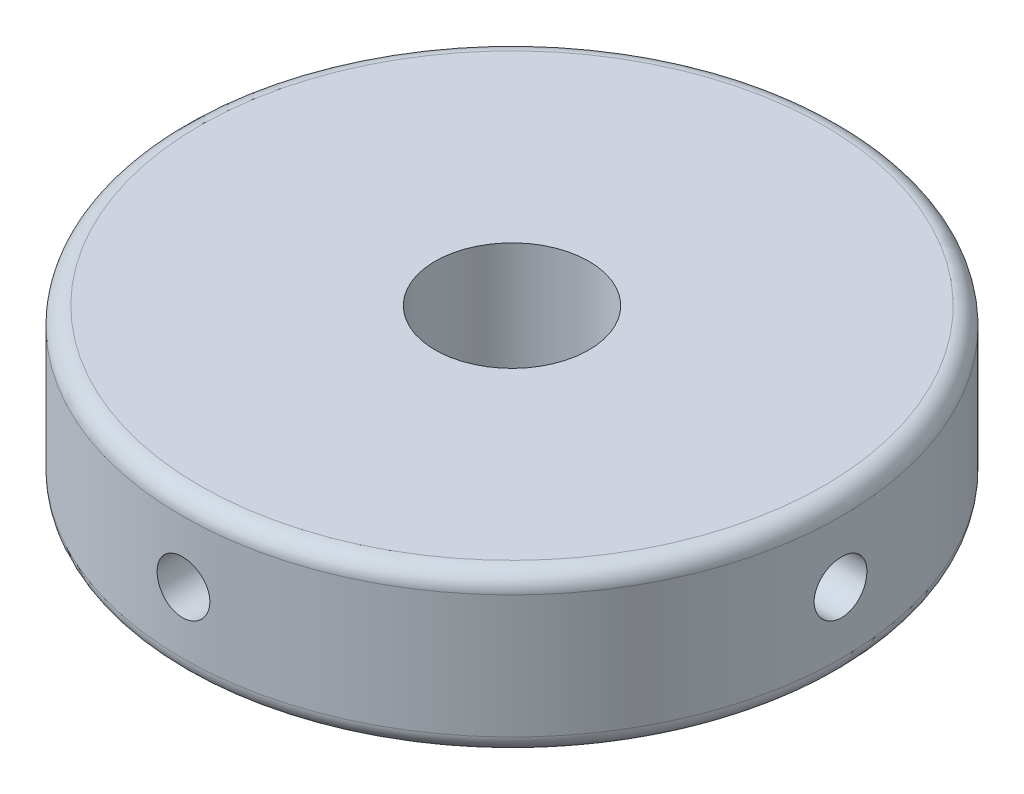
ISO-10303-21;
HEADER;
FILE_DESCRIPTION(('STEP AP214'),'2;1');
FILE_NAME('part.step','',(''),(''),'','','');
FILE_SCHEMA(('AUTOMOTIVE_DESIGN { 1 0 10303 214 1 1 1 1 }'));
ENDSEC;
DATA;
#1=APPLICATION_CONTEXT('core data for automotive mechanical design processes');
#2=APPLICATION_PROTOCOL_DEFINITION('international standard','automotive_design',2000,#1);
#3=PRODUCT_CONTEXT('',#1,'mechanical');
#4=PRODUCT('Part','Part','',(#3));
#5=PRODUCT_RELATED_PRODUCT_CATEGORY('part','',(#4));
#6=PRODUCT_DEFINITION_FORMATION('','',#4);
#7=PRODUCT_DEFINITION_CONTEXT('part definition',#1,'design');
#8=PRODUCT_DEFINITION('design','',#6,#7);
#9=PRODUCT_DEFINITION_SHAPE('','',#8);
#10=(LENGTH_UNIT() NAMED_UNIT(*) SI_UNIT(.MILLI.,.METRE.));
#11=(NAMED_UNIT(*) PLANE_ANGLE_UNIT() SI_UNIT($,.RADIAN.));
#12=(NAMED_UNIT(*) SI_UNIT($,.STERADIAN.) SOLID_ANGLE_UNIT());
#13=UNCERTAINTY_MEASURE_WITH_UNIT(LENGTH_MEASURE(1.E-05),#10,'distance_accuracy_value','');
#14=(GEOMETRIC_REPRESENTATION_CONTEXT(3) GLOBAL_UNCERTAINTY_ASSIGNED_CONTEXT((#13)) GLOBAL_UNIT_ASSIGNED_CONTEXT((#10,
#11,#12)) REPRESENTATION_CONTEXT('',''));
#15=CARTESIAN_POINT('',(0.,0.,0.));
#16=DIRECTION('',(0.,0.,1.));
#17=DIRECTION('',(1.,0.,0.));
#18=AXIS2_PLACEMENT_3D('',#15,#16,#17);
#19=CARTESIAN_POINT('',(0.,18.,0.));
#20=DIRECTION('',(0.,-1.,0.));
#21=DIRECTION('',(0.,0.,-1.));
#22=AXIS2_PLACEMENT_3D('',#19,#20,#21);
#23=CYLINDRICAL_SURFACE('',#22,37.5);
#24=CARTESIAN_POINT('',(0.,2.,0.));
#25=DIRECTION('',(0.,1.,0.));
#26=DIRECTION('',(0.,0.,1.));
#27=AXIS2_PLACEMENT_3D('',#24,#25,#26);
#28=CIRCLE('',#27,37.5);
#29=CARTESIAN_POINT('',(0.,2.,37.5));
#30=VERTEX_POINT('',#29);
#31=EDGE_CURVE('E150',#30,#30,#28,.T.);
#32=ORIENTED_EDGE('',*,*,#31,.T.);
#33=EDGE_LOOP('',(#32));
#34=FACE_BOUND('',#33,.T.);
#35=CARTESIAN_POINT('',(0.,16.,0.));
#36=DIRECTION('',(0.,1.,0.));
#37=DIRECTION('',(0.,0.,1.));
#38=AXIS2_PLACEMENT_3D('',#35,#36,#37);
#39=CIRCLE('',#38,37.5);
#40=CARTESIAN_POINT('',(0.,16.,37.5));
#41=VERTEX_POINT('',#40);
#42=EDGE_CURVE('E144',#41,#41,#39,.F.);
#43=ORIENTED_EDGE('',*,*,#42,.T.);
#44=EDGE_LOOP('',(#43));
#45=FACE_BOUND('',#44,.T.);
#46=CARTESIAN_POINT('',(2.99999999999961,9.00000000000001,37.3798073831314));
#47=CARTESIAN_POINT('',(2.99999264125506,8.83177821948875,37.3798089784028));
#48=CARTESIAN_POINT('',(2.98580312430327,8.6634413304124,37.3809551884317));
#49=CARTESIAN_POINT('',(2.92940637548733,8.33142351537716,37.3854162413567));
#50=CARTESIAN_POINT('',(2.88716724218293,8.16774811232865,37.3887335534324));
#51=CARTESIAN_POINT('',(2.77589918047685,7.84991016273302,37.3971586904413));
#52=CARTESIAN_POINT('',(2.70688525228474,7.69574234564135,37.4022655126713));
#53=CARTESIAN_POINT('',(2.54405292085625,7.40121643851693,37.4136930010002));
#54=CARTESIAN_POINT('',(2.45023988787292,7.26085536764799,37.4200134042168));
#55=CARTESIAN_POINT('',(2.24023103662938,6.99755638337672,37.4331727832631));
#56=CARTESIAN_POINT('',(2.12398849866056,6.87465578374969,37.4400128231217));
#57=CARTESIAN_POINT('',(1.87251889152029,6.65008682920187,37.4534310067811));
#58=CARTESIAN_POINT('',(1.7372910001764,6.54841939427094,37.4600091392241));
#59=CARTESIAN_POINT('',(1.4514683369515,6.36907984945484,37.4721722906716));
#60=CARTESIAN_POINT('',(1.30085336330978,6.29143983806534,37.477755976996));
#61=CARTESIAN_POINT('',(0.988672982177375,6.16256438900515,37.4872896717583));
#62=CARTESIAN_POINT('',(0.827107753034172,6.11132852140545,37.4912397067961));
#63=CARTESIAN_POINT('',(0.497982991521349,6.03682265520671,37.4970536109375));
#64=CARTESIAN_POINT('',(0.330437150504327,6.01349253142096,37.4989219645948));
#65=CARTESIAN_POINT('',(-0.00620202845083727,5.99527457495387,37.5003771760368));
#66=CARTESIAN_POINT('',(-0.175295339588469,6.00038625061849,37.4999640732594));
#67=CARTESIAN_POINT('',(-0.509821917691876,6.03885754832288,37.4969066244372));
#68=CARTESIAN_POINT('',(-0.675262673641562,6.07215251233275,37.4942673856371));
#69=CARTESIAN_POINT('',(-0.998199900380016,6.16594476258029,37.4870604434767));
#70=CARTESIAN_POINT('',(-1.15569630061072,6.22644229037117,37.4824927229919));
#71=CARTESIAN_POINT('',(-1.45848015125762,6.37299463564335,37.4719339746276));
#72=CARTESIAN_POINT('',(-1.60375349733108,6.45907847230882,37.4659413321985));
#73=CARTESIAN_POINT('',(-1.87781350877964,6.65433875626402,37.4532063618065));
#74=CARTESIAN_POINT('',(-2.00659986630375,6.76351563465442,37.4464640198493));
#75=CARTESIAN_POINT('',(-2.24440805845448,7.00222742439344,37.4329652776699));
#76=CARTESIAN_POINT('',(-2.35337351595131,7.13181850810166,37.4262088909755));
#77=CARTESIAN_POINT('',(-2.54801138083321,7.40748414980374,37.4134625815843));
#78=CARTESIAN_POINT('',(-2.63368377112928,7.55355871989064,37.4074726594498));
#79=CARTESIAN_POINT('',(-2.77930109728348,7.85808372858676,37.3969362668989));
#80=CARTESIAN_POINT('',(-2.8392432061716,8.01653552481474,37.3923899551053));
#81=CARTESIAN_POINT('',(-2.93165719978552,8.34129867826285,37.3852585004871));
#82=CARTESIAN_POINT('',(-2.96412961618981,8.50760988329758,37.3826733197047));
#83=CARTESIAN_POINT('',(-3.00061128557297,8.842877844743,37.379762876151));
#84=CARTESIAN_POINT('',(-3.00469911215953,9.01182599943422,37.3794313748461));
#85=CARTESIAN_POINT('',(-2.98450129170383,9.3480052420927,37.381049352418));
#86=CARTESIAN_POINT('',(-2.96021588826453,9.51523634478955,37.3829988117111));
#87=CARTESIAN_POINT('',(-2.88402644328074,9.84300944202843,37.3889533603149));
#88=CARTESIAN_POINT('',(-2.83215898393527,10.0035599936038,37.3929557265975));
#89=CARTESIAN_POINT('',(-2.70231491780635,10.3136794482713,37.4025628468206));
#90=CARTESIAN_POINT('',(-2.62433792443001,10.4632481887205,37.4081676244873));
#91=CARTESIAN_POINT('',(-2.44428909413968,10.747518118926,37.4203631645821));
#92=CARTESIAN_POINT('',(-2.34216484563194,10.8821860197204,37.4269560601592));
#93=CARTESIAN_POINT('',(-2.11679623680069,11.1324952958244,37.4403777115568));
#94=CARTESIAN_POINT('',(-1.99355154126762,11.2481363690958,37.4472064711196));
#95=CARTESIAN_POINT('',(-1.72910120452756,11.4573770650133,37.4603489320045));
#96=CARTESIAN_POINT('',(-1.58785513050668,11.550925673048,37.4666614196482));
#97=CARTESIAN_POINT('',(-1.291613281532,11.7129760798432,37.4780426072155));
#98=CARTESIAN_POINT('',(-1.13661763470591,11.781478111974,37.4831113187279));
#99=CARTESIAN_POINT('',(-0.817460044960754,11.8914030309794,37.4914282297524));
#100=CARTESIAN_POINT('',(-0.6533090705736,11.9328575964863,37.494678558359));
#101=CARTESIAN_POINT('',(-0.320349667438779,11.9876144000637,37.4990010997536));
#102=CARTESIAN_POINT('',(-0.151541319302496,12.0009171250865,37.5000733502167));
#103=CARTESIAN_POINT('',(0.185437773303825,11.9989871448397,37.4999189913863));
#104=CARTESIAN_POINT('',(0.353608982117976,11.9838340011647,37.4986987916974));
#105=CARTESIAN_POINT('',(0.685010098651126,11.9255881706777,37.4941093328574));
#106=CARTESIAN_POINT('',(0.848239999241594,11.882495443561,37.4907400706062));
#107=CARTESIAN_POINT('',(1.16513127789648,11.7696135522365,37.4822306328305));
#108=CARTESIAN_POINT('',(1.31879310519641,11.6998256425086,37.4770905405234));
#109=CARTESIAN_POINT('',(1.61223186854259,11.5355437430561,37.4656148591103));
#110=CARTESIAN_POINT('',(1.75200904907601,11.4410501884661,37.4592792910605));
#111=CARTESIAN_POINT('',(2.01411759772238,11.2297409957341,37.4461029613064));
#112=CARTESIAN_POINT('',(2.1364015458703,11.1128666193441,37.4392608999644));
#113=CARTESIAN_POINT('',(2.35966449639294,10.8602165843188,37.4258537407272));
#114=CARTESIAN_POINT('',(2.46063832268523,10.7244363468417,37.41928871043));
#115=CARTESIAN_POINT('',(2.63854009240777,10.4375850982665,37.4071663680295));
#116=CARTESIAN_POINT('',(2.7154254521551,10.2864876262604,37.4016108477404));
#117=CARTESIAN_POINT('',(2.84263710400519,9.97358775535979,37.3921585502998));
#118=CARTESIAN_POINT('',(2.8929940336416,9.8117979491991,37.3882598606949));
#119=CARTESIAN_POINT('',(2.95284675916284,9.54087260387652,37.3835687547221));
#120=CARTESIAN_POINT('',(2.97050583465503,9.4334811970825,37.3821646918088));
#121=CARTESIAN_POINT('',(2.99408481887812,9.21740922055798,37.3802834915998));
#122=CARTESIAN_POINT('',(3.00000475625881,9.10872865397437,37.3798063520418));
#123=CARTESIAN_POINT('',(2.99999999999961,9.00000000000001,37.3798073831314));
#124=B_SPLINE_CURVE_WITH_KNOTS('',3,(#46,#47,#48,#49,#50,#51,#52,#53,#54,#55,#56,#57,#58,#59,
#60,#61,#62,#63,#64,#65,#66,#67,#68,#69,#70,#71,#72,#73,#74,#75,#76,#77,#78,#79,#80,#81,#82,#83,
#84,#85,#86,#87,#88,#89,#90,#91,#92,#93,#94,#95,#96,#97,#98,#99,#100,#101,#102,#103,#104,#105,
#106,#107,#108,#109,#110,#111,#112,#113,#114,#115,#116,#117,#118,#119,#120,#121,#122,#123),
.UNSPECIFIED.,.T.,.F.,(4,2,2,2,2,2,2,2,2,2,2,2,2,2,2,2,2,2,2,2,2,2,2,2,2,2,2,2,2,2,2,2,2,2,2,2,
2,2,4),(0.,0.504268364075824,1.00911122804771,1.51367166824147,2.01812293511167,
2.52363652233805,3.02917200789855,3.53537995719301,4.04157966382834,4.54668674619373,
5.05178509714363,5.55572778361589,6.05967494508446,6.56419586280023,7.0687261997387,
7.57466988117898,8.08061393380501,8.58661355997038,9.09260339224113,9.59719199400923,
10.101776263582,10.6056929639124,11.1096171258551,11.6146452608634,12.1196814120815,
12.6258726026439,13.1320590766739,13.6376516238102,14.1432354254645,14.647407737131,
15.1515807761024,15.6557301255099,16.1598705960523,16.6653527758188,17.1709575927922,
17.6774512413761,18.1833586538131,18.5092888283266,18.8352182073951),.UNSPECIFIED.);
#125=CARTESIAN_POINT('',(2.99999999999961,9.00000000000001,37.3798073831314));
#126=VERTEX_POINT('',#125);
#127=EDGE_CURVE('E139',#126,#126,#124,.T.);
#128=ORIENTED_EDGE('',*,*,#127,.T.);
#129=EDGE_LOOP('',(#128));
#130=FACE_BOUND('',#129,.T.);
#131=CARTESIAN_POINT('',(37.3798073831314,9.00000000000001,-2.99999999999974));
#132=CARTESIAN_POINT('',(37.3798089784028,8.83177821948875,-2.99999264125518));
#133=CARTESIAN_POINT('',(37.3809551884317,8.6634413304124,-2.98580312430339));
#134=CARTESIAN_POINT('',(37.3854162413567,8.33142351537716,-2.92940637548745));
#135=CARTESIAN_POINT('',(37.3887335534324,8.16774811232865,-2.88716724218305));
#136=CARTESIAN_POINT('',(37.3971586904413,7.84991016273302,-2.77589918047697));
#137=CARTESIAN_POINT('',(37.4022655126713,7.69574234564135,-2.70688525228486));
#138=CARTESIAN_POINT('',(37.4136930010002,7.40121643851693,-2.54405292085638));
#139=CARTESIAN_POINT('',(37.4200134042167,7.26085536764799,-2.45023988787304));
#140=CARTESIAN_POINT('',(37.4331727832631,6.99755638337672,-2.2402310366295));
#141=CARTESIAN_POINT('',(37.4400128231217,6.87465578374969,-2.12398849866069));
#142=CARTESIAN_POINT('',(37.4534310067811,6.65008682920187,-1.87251889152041));
#143=CARTESIAN_POINT('',(37.4600091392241,6.54841939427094,-1.73729100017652));
#144=CARTESIAN_POINT('',(37.4721722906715,6.36907984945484,-1.45146833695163));
#145=CARTESIAN_POINT('',(37.477755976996,6.29143983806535,-1.3008533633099));
#146=CARTESIAN_POINT('',(37.4872896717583,6.16256438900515,-0.9886729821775));
#147=CARTESIAN_POINT('',(37.4912397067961,6.11132852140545,-0.827107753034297));
#148=CARTESIAN_POINT('',(37.4970536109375,6.03682265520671,-0.497982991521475));
#149=CARTESIAN_POINT('',(37.4989219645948,6.01349253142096,-0.330437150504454));
#150=CARTESIAN_POINT('',(37.5003771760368,5.99527457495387,0.00620202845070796));
#151=CARTESIAN_POINT('',(37.4999640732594,6.00038625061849,0.175295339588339));
#152=CARTESIAN_POINT('',(37.4969066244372,6.03885754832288,0.509821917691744));
#153=CARTESIAN_POINT('',(37.4942673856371,6.07215251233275,0.67526267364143));
#154=CARTESIAN_POINT('',(37.4870604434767,6.16594476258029,0.998199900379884));
#155=CARTESIAN_POINT('',(37.4824927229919,6.22644229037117,1.15569630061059));
#156=CARTESIAN_POINT('',(37.4719339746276,6.37299463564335,1.45848015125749));
#157=CARTESIAN_POINT('',(37.4659413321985,6.45907847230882,1.60375349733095));
#158=CARTESIAN_POINT('',(37.4532063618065,6.65433875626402,1.87781350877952));
#159=CARTESIAN_POINT('',(37.4464640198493,6.76351563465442,2.00659986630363));
#160=CARTESIAN_POINT('',(37.4329652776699,7.00222742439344,2.24440805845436));
#161=CARTESIAN_POINT('',(37.4262088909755,7.13181850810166,2.35337351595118));
#162=CARTESIAN_POINT('',(37.4134625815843,7.40748414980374,2.54801138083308));
#163=CARTESIAN_POINT('',(37.4074726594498,7.55355871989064,2.63368377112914));
#164=CARTESIAN_POINT('',(37.3969362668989,7.85808372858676,2.77930109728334));
#165=CARTESIAN_POINT('',(37.3923899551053,8.01653552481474,2.83924320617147));
#166=CARTESIAN_POINT('',(37.3852585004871,8.34129867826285,2.93165719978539));
#167=CARTESIAN_POINT('',(37.3826733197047,8.50760988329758,2.96412961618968));
#168=CARTESIAN_POINT('',(37.379762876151,8.842877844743,3.00061128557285));
#169=CARTESIAN_POINT('',(37.3794313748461,9.01182599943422,3.0046991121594));
#170=CARTESIAN_POINT('',(37.381049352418,9.3480052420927,2.98450129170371));
#171=CARTESIAN_POINT('',(37.3829988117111,9.51523634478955,2.96021588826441));
#172=CARTESIAN_POINT('',(37.3889533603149,9.84300944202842,2.88402644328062));
#173=CARTESIAN_POINT('',(37.3929557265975,10.0035599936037,2.83215898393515));
#174=CARTESIAN_POINT('',(37.4025628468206,10.3136794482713,2.70231491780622));
#175=CARTESIAN_POINT('',(37.4081676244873,10.4632481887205,2.62433792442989));
#176=CARTESIAN_POINT('',(37.4203631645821,10.747518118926,2.44428909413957));
#177=CARTESIAN_POINT('',(37.4269560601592,10.8821860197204,2.34216484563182));
#178=CARTESIAN_POINT('',(37.4403777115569,11.1324952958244,2.11679623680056));
#179=CARTESIAN_POINT('',(37.4472064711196,11.2481363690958,1.9935515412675));
#180=CARTESIAN_POINT('',(37.4603489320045,11.4573770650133,1.72910120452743));
#181=CARTESIAN_POINT('',(37.4666614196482,11.550925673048,1.58785513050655));
#182=CARTESIAN_POINT('',(37.4780426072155,11.7129760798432,1.29161328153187));
#183=CARTESIAN_POINT('',(37.4831113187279,11.781478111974,1.13661763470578));
#184=CARTESIAN_POINT('',(37.4914282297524,11.8914030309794,0.817460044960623));
#185=CARTESIAN_POINT('',(37.494678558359,11.9328575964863,0.653309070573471));
#186=CARTESIAN_POINT('',(37.4990010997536,11.9876144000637,0.320349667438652));
#187=CARTESIAN_POINT('',(37.5000733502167,12.0009171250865,0.15154131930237));
#188=CARTESIAN_POINT('',(37.4999189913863,11.9989871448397,-0.185437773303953));
#189=CARTESIAN_POINT('',(37.4986987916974,11.9838340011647,-0.353608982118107));
#190=CARTESIAN_POINT('',(37.4941093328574,11.9255881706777,-0.685010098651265));
#191=CARTESIAN_POINT('',(37.4907400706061,11.882495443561,-0.848239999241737));
#192=CARTESIAN_POINT('',(37.4822306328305,11.7696135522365,-1.16513127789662));
#193=CARTESIAN_POINT('',(37.4770905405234,11.6998256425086,-1.31879310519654));
#194=CARTESIAN_POINT('',(37.4656148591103,11.5355437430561,-1.61223186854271));
#195=CARTESIAN_POINT('',(37.4592792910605,11.4410501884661,-1.75200904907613));
#196=CARTESIAN_POINT('',(37.4461029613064,11.2297409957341,-2.0141175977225));
#197=CARTESIAN_POINT('',(37.4392608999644,11.1128666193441,-2.13640154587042));
#198=CARTESIAN_POINT('',(37.4258537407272,10.8602165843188,-2.35966449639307));
#199=CARTESIAN_POINT('',(37.41928871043,10.7244363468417,-2.46063832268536));
#200=CARTESIAN_POINT('',(37.4071663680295,10.4375850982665,-2.6385400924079));
#201=CARTESIAN_POINT('',(37.4016108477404,10.2864876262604,-2.71542545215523));
#202=CARTESIAN_POINT('',(37.3921585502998,9.97358775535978,-2.84263710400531));
#203=CARTESIAN_POINT('',(37.3882598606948,9.8117979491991,-2.89299403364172));
#204=CARTESIAN_POINT('',(37.3835687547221,9.54087260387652,-2.95284675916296));
#205=CARTESIAN_POINT('',(37.3821646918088,9.4334811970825,-2.97050583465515));
#206=CARTESIAN_POINT('',(37.3802834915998,9.21740922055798,-2.99408481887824));
#207=CARTESIAN_POINT('',(37.3798063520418,9.10872865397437,-3.00000475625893));
#208=CARTESIAN_POINT('',(37.3798073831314,9.00000000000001,-2.99999999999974));
#209=B_SPLINE_CURVE_WITH_KNOTS('',3,(#131,#132,#133,#134,#135,#136,#137,#138,#139,#140,#141,
#142,#143,#144,#145,#146,#147,#148,#149,#150,#151,#152,#153,#154,#155,#156,#157,#158,#159,#160,
#161,#162,#163,#164,#165,#166,#167,#168,#169,#170,#171,#172,#173,#174,#175,#176,#177,#178,#179,
#180,#181,#182,#183,#184,#185,#186,#187,#188,#189,#190,#191,#192,#193,#194,#195,#196,#197,#198,
#199,#200,#201,#202,#203,#204,#205,#206,#207,#208),.UNSPECIFIED.,.T.,.F.,(4,2,2,2,2,2,2,2,2,2,2,
2,2,2,2,2,2,2,2,2,2,2,2,2,2,2,2,2,2,2,2,2,2,2,2,2,2,2,4),(0.,0.504268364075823,1.00911122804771,
1.51367166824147,2.01812293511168,2.52363652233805,3.02917200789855,3.53537995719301,
4.04157966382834,4.54668674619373,5.05178509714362,5.55572778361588,6.05967494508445,
6.56419586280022,7.0687261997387,7.57466988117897,8.080613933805,8.58661355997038,
9.09260339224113,9.59719199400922,10.101776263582,10.6056929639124,11.1096171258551,
11.6146452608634,12.1196814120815,12.6258726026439,13.1320590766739,13.6376516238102,
14.1432354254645,14.647407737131,15.1515807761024,15.6557301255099,16.1598705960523,
16.6653527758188,17.1709575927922,17.6774512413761,18.1833586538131,18.5092888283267,
18.8352182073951),.UNSPECIFIED.);
#210=CARTESIAN_POINT('',(37.3798073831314,9.00000000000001,-2.99999999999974));
#211=VERTEX_POINT('',#210);
#212=EDGE_CURVE('E145',#211,#211,#209,.T.);
#213=ORIENTED_EDGE('',*,*,#212,.T.);
#214=EDGE_LOOP('',(#213));
#215=FACE_BOUND('',#214,.T.);
#216=CARTESIAN_POINT('',(0.,12.,-37.5));
#217=CARTESIAN_POINT('',(-0.168222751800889,11.9999926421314,-37.4999984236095));
#218=CARTESIAN_POINT('',(-0.336560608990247,11.985802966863,-37.4988559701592));
#219=CARTESIAN_POINT('',(-0.668580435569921,11.9294055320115,-37.4944083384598));
#220=CARTESIAN_POINT('',(-0.832256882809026,11.887165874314,-37.4911006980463));
#221=CARTESIAN_POINT('',(-1.15009704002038,11.7758962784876,-37.4826965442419));
#222=CARTESIAN_POINT('',(-1.30426601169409,11.7068813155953,-37.4776010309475));
#223=CARTESIAN_POINT('',(-1.5987938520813,11.5440465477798,-37.4661928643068));
#224=CARTESIAN_POINT('',(-1.73915570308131,11.4502321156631,-37.459880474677));
#225=CARTESIAN_POINT('',(-2.00245380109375,11.2402218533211,-37.4467304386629));
#226=CARTESIAN_POINT('',(-2.12535298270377,11.1239796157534,-37.4398917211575));
#227=CARTESIAN_POINT('',(-2.34991920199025,10.8725112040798,-37.4264688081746));
#228=CARTESIAN_POINT('',(-2.45158531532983,10.7372842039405,-37.4198846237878));
#229=CARTESIAN_POINT('',(-2.63092348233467,10.4514623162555,-37.4077045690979));
#230=CARTESIAN_POINT('',(-2.70856319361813,10.3008470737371,-37.4021100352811));
#231=CARTESIAN_POINT('',(-2.83743801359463,9.98866610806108,-37.3925546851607));
#232=CARTESIAN_POINT('',(-2.88867355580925,9.8271005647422,-37.3885938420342));
#233=CARTESIAN_POINT('',(-2.96317873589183,9.49797486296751,-37.3827631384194));
#234=CARTESIAN_POINT('',(-2.98650847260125,9.33042839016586,-37.3808887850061));
#235=CARTESIAN_POINT('',(-3.00472543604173,8.99378797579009,-37.3794290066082));
#236=CARTESIAN_POINT('',(-2.99961315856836,8.82469406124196,-37.3798435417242));
#237=CARTESIAN_POINT('',(-2.96114091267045,8.49017014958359,-37.3829106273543));
#238=CARTESIAN_POINT('',(-2.92784620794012,8.32473259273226,-37.3855580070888));
#239=CARTESIAN_POINT('',(-2.83405558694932,8.00180163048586,-37.3927843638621));
#240=CARTESIAN_POINT('',(-2.77355942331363,7.84430829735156,-37.3973633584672));
#241=CARTESIAN_POINT('',(-2.62700989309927,7.54152814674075,-37.4079429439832));
#242=CARTESIAN_POINT('',(-2.54092718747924,7.3962555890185,-37.4139451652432));
#243=CARTESIAN_POINT('',(-2.34566931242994,7.12219667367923,-37.4266933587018));
#244=CARTESIAN_POINT('',(-2.23649371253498,6.99341062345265,-37.4334393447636));
#245=CARTESIAN_POINT('',(-1.99778282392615,6.75560096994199,-37.4469379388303));
#246=CARTESIAN_POINT('',(-1.86819110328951,6.64663400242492,-37.4536905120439));
#247=CARTESIAN_POINT('',(-1.5925236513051,6.45199339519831,-37.466423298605));
#248=CARTESIAN_POINT('',(-1.44644791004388,6.36631976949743,-37.4724035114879));
#249=CARTESIAN_POINT('',(-1.14192259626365,6.22070155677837,-37.4829187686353));
#250=CARTESIAN_POINT('',(-0.983471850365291,6.16075941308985,-37.4874536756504));
#251=CARTESIAN_POINT('',(-0.658710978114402,6.06834502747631,-37.4945657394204));
#252=CARTESIAN_POINT('',(-0.492401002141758,6.03587226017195,-37.4971429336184));
#253=CARTESIAN_POINT('',(-0.157133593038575,5.99938926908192,-37.5000443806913));
#254=CARTESIAN_POINT('',(0.0118152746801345,5.99530080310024,-37.5003748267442));
#255=CARTESIAN_POINT('',(0.347996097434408,6.01549759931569,-37.4987620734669));
#256=CARTESIAN_POINT('',(0.515228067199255,6.03978261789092,-37.4968188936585));
#257=CARTESIAN_POINT('',(0.843005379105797,6.11597218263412,-37.4908814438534));
#258=CARTESIAN_POINT('',(1.00355918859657,6.1678405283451,-37.4868898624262));
#259=CARTESIAN_POINT('',(1.31368476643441,6.29768745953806,-37.4773041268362));
#260=CARTESIAN_POINT('',(1.46325637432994,6.37566642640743,-37.4717099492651));
#261=CARTESIAN_POINT('',(1.74752822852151,6.55571814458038,-37.459530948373));
#262=CARTESIAN_POINT('',(1.88219550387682,6.65784280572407,-37.4529440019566));
#263=CARTESIAN_POINT('',(2.13250332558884,6.88321188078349,-37.4395268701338));
#264=CARTESIAN_POINT('',(2.24814356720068,7.00645663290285,-37.4326966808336));
#265=CARTESIAN_POINT('',(2.45738250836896,7.27090660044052,-37.4195445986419));
#266=CARTESIAN_POINT('',(2.55093020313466,7.41215223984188,-37.4132239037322));
#267=CARTESIAN_POINT('',(2.71297900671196,7.708392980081,-37.4018231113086));
#268=CARTESIAN_POINT('',(2.78148034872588,7.86338795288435,-37.3967430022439));
#269=CARTESIAN_POINT('',(2.89140480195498,8.18254600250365,-37.3884050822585));
#270=CARTESIAN_POINT('',(2.93285929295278,8.34669821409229,-37.385145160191));
#271=CARTESIAN_POINT('',(2.98761552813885,8.67966022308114,-37.3808095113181));
#272=CARTESIAN_POINT('',(3.00091776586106,8.84846993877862,-37.3797337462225));
#273=CARTESIAN_POINT('',(2.99898638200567,9.18544816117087,-37.3798887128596));
#274=CARTESIAN_POINT('',(2.98383290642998,9.35361713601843,-37.3811129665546));
#275=CARTESIAN_POINT('',(2.92558719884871,9.68501370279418,-37.3857162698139));
#276=CARTESIAN_POINT('',(2.88249492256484,9.84824128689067,-37.3890953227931));
#277=CARTESIAN_POINT('',(2.76961478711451,10.1651279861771,-37.3976257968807));
#278=CARTESIAN_POINT('',(2.69982819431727,10.3187875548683,-37.4027771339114));
#279=CARTESIAN_POINT('',(2.53554962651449,10.6122223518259,-37.414271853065));
#280=CARTESIAN_POINT('',(2.44105808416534,10.7519978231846,-37.4206152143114));
#281=CARTESIAN_POINT('',(2.2297510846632,11.0141065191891,-37.4338004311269));
#282=CARTESIAN_POINT('',(2.11287643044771,11.1363919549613,-37.4406435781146));
#283=CARTESIAN_POINT('',(1.86022523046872,11.359657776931,-37.4540455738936));
#284=CARTESIAN_POINT('',(1.72444410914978,11.4606329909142,-37.4606043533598));
#285=CARTESIAN_POINT('',(1.43759216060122,11.6385362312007,-37.4727095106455));
#286=CARTESIAN_POINT('',(1.28649503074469,11.7154219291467,-37.4782540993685));
#287=CARTESIAN_POINT('',(0.973595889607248,11.8426343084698,-37.4876847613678));
#288=CARTESIAN_POINT('',(0.811806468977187,11.8929916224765,-37.4915727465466));
#289=CARTESIAN_POINT('',(0.540880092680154,11.9528454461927,-37.4962502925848));
#290=CARTESIAN_POINT('',(0.433487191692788,11.9705050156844,-37.4976500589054));
#291=CARTESIAN_POINT('',(0.217412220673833,11.9940846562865,-37.4995254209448));
#292=CARTESIAN_POINT('',(0.108730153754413,12.0000047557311,-37.5000010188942));
#293=CARTESIAN_POINT('',(0.,12.,-37.5));
#294=B_SPLINE_CURVE_WITH_KNOTS('',3,(#216,#217,#218,#219,#220,#221,#222,#223,#224,#225,#226,
#227,#228,#229,#230,#231,#232,#233,#234,#235,#236,#237,#238,#239,#240,#241,#242,#243,#244,#245,
#246,#247,#248,#249,#250,#251,#252,#253,#254,#255,#256,#257,#258,#259,#260,#261,#262,#263,#264,
#265,#266,#267,#268,#269,#270,#271,#272,#273,#274,#275,#276,#277,#278,#279,#280,#281,#282,#283,
#284,#285,#286,#287,#288,#289,#290,#291,#292,#293),.UNSPECIFIED.,.T.,.F.,(4,2,2,2,2,2,2,2,2,2,2,
2,2,2,2,2,2,2,2,2,2,2,2,2,2,2,2,2,2,2,2,2,2,2,2,2,2,2,4),(0.,0.504271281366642,1.00911699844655,
1.51368076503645,2.01813530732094,2.52364507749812,3.02917684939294,3.53538619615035,
4.04158723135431,4.5466961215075,5.05179620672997,5.55572979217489,6.0596679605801,
6.56418621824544,7.0687138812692,7.57466139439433,8.08060921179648,8.58660506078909,
9.09259123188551,9.59718208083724,10.1017685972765,10.605694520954,11.1096278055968,
11.614654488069,12.1196892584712,12.6258788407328,13.1320637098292,13.6376602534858,
14.1432479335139,14.6474137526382,15.1515803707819,15.6557230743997,16.1598569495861,
16.6653430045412,17.170951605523,17.6774437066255,18.1833496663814,18.5092843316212,
18.8352182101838),.UNSPECIFIED.);
#295=CARTESIAN_POINT('',(0.,12.,-37.5));
#296=VERTEX_POINT('',#295);
#297=EDGE_CURVE('E86',#296,#296,#294,.T.);
#298=ORIENTED_EDGE('',*,*,#297,.T.);
#299=EDGE_LOOP('',(#298));
#300=FACE_BOUND('',#299,.T.);
#301=CARTESIAN_POINT('',(-37.3798073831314,9.00000000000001,3.));
#302=CARTESIAN_POINT('',(-37.3798089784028,8.83177821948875,2.99999264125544));
#303=CARTESIAN_POINT('',(-37.3809551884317,8.6634413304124,2.98580312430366));
#304=CARTESIAN_POINT('',(-37.3854162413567,8.33142351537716,2.92940637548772));
#305=CARTESIAN_POINT('',(-37.3887335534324,8.16774811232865,2.88716724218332));
#306=CARTESIAN_POINT('',(-37.3971586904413,7.84991016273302,2.77589918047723));
#307=CARTESIAN_POINT('',(-37.4022655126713,7.69574234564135,2.70688525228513));
#308=CARTESIAN_POINT('',(-37.4136930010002,7.40121643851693,2.54405292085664));
#309=CARTESIAN_POINT('',(-37.4200134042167,7.26085536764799,2.4502398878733));
#310=CARTESIAN_POINT('',(-37.4331727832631,6.99755638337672,2.24023103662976));
#311=CARTESIAN_POINT('',(-37.4400128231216,6.87465578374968,2.12398849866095));
#312=CARTESIAN_POINT('',(-37.4534310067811,6.65008682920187,1.87251889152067));
#313=CARTESIAN_POINT('',(-37.4600091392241,6.54841939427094,1.73729100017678));
#314=CARTESIAN_POINT('',(-37.4721722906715,6.36907984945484,1.45146833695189));
#315=CARTESIAN_POINT('',(-37.477755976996,6.29143983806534,1.30085336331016));
#316=CARTESIAN_POINT('',(-37.4872896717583,6.16256438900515,0.988672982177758));
#317=CARTESIAN_POINT('',(-37.4912397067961,6.11132852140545,0.827107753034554));
#318=CARTESIAN_POINT('',(-37.4970536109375,6.03682265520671,0.497982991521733));
#319=CARTESIAN_POINT('',(-37.4989219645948,6.01349253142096,0.330437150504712));
#320=CARTESIAN_POINT('',(-37.5003771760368,5.99527457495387,-0.00620202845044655));
#321=CARTESIAN_POINT('',(-37.4999640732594,6.00038625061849,-0.175295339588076));
#322=CARTESIAN_POINT('',(-37.4969066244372,6.03885754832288,-0.509821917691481));
#323=CARTESIAN_POINT('',(-37.4942673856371,6.07215251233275,-0.675262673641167));
#324=CARTESIAN_POINT('',(-37.4870604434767,6.16594476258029,-0.998199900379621));
#325=CARTESIAN_POINT('',(-37.4824927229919,6.22644229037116,-1.15569630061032));
#326=CARTESIAN_POINT('',(-37.4719339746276,6.37299463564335,-1.45848015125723));
#327=CARTESIAN_POINT('',(-37.4659413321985,6.45907847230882,-1.60375349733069));
#328=CARTESIAN_POINT('',(-37.4532063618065,6.65433875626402,-1.87781350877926));
#329=CARTESIAN_POINT('',(-37.4464640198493,6.76351563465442,-2.00659986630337));
#330=CARTESIAN_POINT('',(-37.43296527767,7.00222742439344,-2.2444080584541));
#331=CARTESIAN_POINT('',(-37.4262088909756,7.13181850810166,-2.35337351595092));
#332=CARTESIAN_POINT('',(-37.4134625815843,7.40748414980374,-2.54801138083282));
#333=CARTESIAN_POINT('',(-37.4074726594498,7.55355871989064,-2.63368377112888));
#334=CARTESIAN_POINT('',(-37.3969362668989,7.85808372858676,-2.77930109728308));
#335=CARTESIAN_POINT('',(-37.3923899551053,8.01653552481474,-2.8392432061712));
#336=CARTESIAN_POINT('',(-37.3852585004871,8.34129867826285,-2.93165719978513));
#337=CARTESIAN_POINT('',(-37.3826733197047,8.50760988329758,-2.96412961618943));
#338=CARTESIAN_POINT('',(-37.379762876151,8.842877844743,-3.00061128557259));
#339=CARTESIAN_POINT('',(-37.3794313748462,9.01182599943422,-3.00469911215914));
#340=CARTESIAN_POINT('',(-37.381049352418,9.3480052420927,-2.98450129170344));
#341=CARTESIAN_POINT('',(-37.3829988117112,9.51523634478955,-2.96021588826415));
#342=CARTESIAN_POINT('',(-37.3889533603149,9.84300944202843,-2.88402644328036));
#343=CARTESIAN_POINT('',(-37.3929557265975,10.0035599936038,-2.83215898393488));
#344=CARTESIAN_POINT('',(-37.4025628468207,10.3136794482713,-2.70231491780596));
#345=CARTESIAN_POINT('',(-37.4081676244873,10.4632481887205,-2.62433792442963));
#346=CARTESIAN_POINT('',(-37.4203631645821,10.747518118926,-2.4442890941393));
#347=CARTESIAN_POINT('',(-37.4269560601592,10.8821860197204,-2.34216484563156));
#348=CARTESIAN_POINT('',(-37.4403777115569,11.1324952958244,-2.1167962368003));
#349=CARTESIAN_POINT('',(-37.4472064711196,11.2481363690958,-1.99355154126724));
#350=CARTESIAN_POINT('',(-37.4603489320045,11.4573770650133,-1.72910120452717));
#351=CARTESIAN_POINT('',(-37.4666614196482,11.550925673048,-1.58785513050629));
#352=CARTESIAN_POINT('',(-37.4780426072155,11.7129760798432,-1.29161328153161));
#353=CARTESIAN_POINT('',(-37.4831113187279,11.781478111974,-1.13661763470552));
#354=CARTESIAN_POINT('',(-37.4914282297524,11.8914030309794,-0.81746004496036));
#355=CARTESIAN_POINT('',(-37.494678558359,11.9328575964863,-0.653309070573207));
#356=CARTESIAN_POINT('',(-37.4990010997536,11.9876144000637,-0.320349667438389));
#357=CARTESIAN_POINT('',(-37.5000733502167,12.0009171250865,-0.151541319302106));
#358=CARTESIAN_POINT('',(-37.4999189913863,11.9989871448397,0.185437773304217));
#359=CARTESIAN_POINT('',(-37.4986987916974,11.9838340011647,0.353608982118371));
#360=CARTESIAN_POINT('',(-37.4941093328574,11.9255881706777,0.685010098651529));
#361=CARTESIAN_POINT('',(-37.4907400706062,11.882495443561,0.848239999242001));
#362=CARTESIAN_POINT('',(-37.4822306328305,11.7696135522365,1.16513127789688));
#363=CARTESIAN_POINT('',(-37.4770905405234,11.6998256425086,1.3187931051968));
#364=CARTESIAN_POINT('',(-37.4656148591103,11.5355437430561,1.61223186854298));
#365=CARTESIAN_POINT('',(-37.4592792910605,11.4410501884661,1.7520090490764));
#366=CARTESIAN_POINT('',(-37.4461029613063,11.2297409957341,2.01411759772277));
#367=CARTESIAN_POINT('',(-37.4392608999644,11.1128666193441,2.13640154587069));
#368=CARTESIAN_POINT('',(-37.4258537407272,10.8602165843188,2.35966449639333));
#369=CARTESIAN_POINT('',(-37.4192887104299,10.7244363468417,2.46063832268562));
#370=CARTESIAN_POINT('',(-37.4071663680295,10.4375850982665,2.63854009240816));
#371=CARTESIAN_POINT('',(-37.4016108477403,10.2864876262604,2.71542545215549));
#372=CARTESIAN_POINT('',(-37.3921585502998,9.97358775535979,2.84263710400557));
#373=CARTESIAN_POINT('',(-37.3882598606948,9.8117979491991,2.89299403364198));
#374=CARTESIAN_POINT('',(-37.3835687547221,9.54087260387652,2.95284675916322));
#375=CARTESIAN_POINT('',(-37.3821646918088,9.4334811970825,2.97050583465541));
#376=CARTESIAN_POINT('',(-37.3802834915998,9.21740922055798,2.99408481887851));
#377=CARTESIAN_POINT('',(-37.3798063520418,9.10872865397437,3.00000475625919));
#378=CARTESIAN_POINT('',(-37.3798073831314,9.00000000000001,3.));
#379=B_SPLINE_CURVE_WITH_KNOTS('',3,(#301,#302,#303,#304,#305,#306,#307,#308,#309,#310,#311,
#312,#313,#314,#315,#316,#317,#318,#319,#320,#321,#322,#323,#324,#325,#326,#327,#328,#329,#330,
#331,#332,#333,#334,#335,#336,#337,#338,#339,#340,#341,#342,#343,#344,#345,#346,#347,#348,#349,
#350,#351,#352,#353,#354,#355,#356,#357,#358,#359,#360,#361,#362,#363,#364,#365,#366,#367,#368,
#369,#370,#371,#372,#373,#374,#375,#376,#377,#378),.UNSPECIFIED.,.T.,.F.,(4,2,2,2,2,2,2,2,2,2,2,
2,2,2,2,2,2,2,2,2,2,2,2,2,2,2,2,2,2,2,2,2,2,2,2,2,2,2,4),(0.,0.504268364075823,1.00911122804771,
1.51367166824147,2.01812293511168,2.52363652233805,3.02917200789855,3.53537995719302,
4.04157966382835,4.54668674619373,5.05178509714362,5.55572778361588,6.05967494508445,
6.56419586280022,7.0687261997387,7.57466988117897,8.080613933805,8.58661355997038,
9.09260339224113,9.59719199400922,10.101776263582,10.6056929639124,11.1096171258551,
11.6146452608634,12.1196814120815,12.6258726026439,13.1320590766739,13.6376516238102,
14.1432354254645,14.647407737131,15.1515807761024,15.6557301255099,16.1598705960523,
16.6653527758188,17.1709575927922,17.6774512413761,18.1833586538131,18.5092888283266,
18.8352182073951),.UNSPECIFIED.);
#380=CARTESIAN_POINT('',(-37.3798073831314,9.00000000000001,3.));
#381=VERTEX_POINT('',#380);
#382=EDGE_CURVE('E80',#381,#381,#379,.T.);
#383=ORIENTED_EDGE('',*,*,#382,.T.);
#384=EDGE_LOOP('',(#383));
#385=FACE_BOUND('',#384,.T.);
#386=ADVANCED_FACE('F32',(#34,#45,#130,#215,#300,#385),#23,.T.);
#387=CARTESIAN_POINT('',(0.,18.,0.));
#388=DIRECTION('',(0.,1.,0.));
#389=DIRECTION('',(0.,0.,1.));
#390=AXIS2_PLACEMENT_3D('',#387,#388,#389);
#391=PLANE('',#390);
#392=CARTESIAN_POINT('',(0.,18.,0.));
#393=DIRECTION('',(0.,1.,0.));
#394=DIRECTION('',(0.,0.,1.));
#395=AXIS2_PLACEMENT_3D('',#392,#393,#394);
#396=CIRCLE('',#395,35.5);
#397=CARTESIAN_POINT('',(0.,18.,35.5));
#398=VERTEX_POINT('',#397);
#399=EDGE_CURVE('E11',#398,#398,#396,.T.);
#400=ORIENTED_EDGE('',*,*,#399,.T.);
#401=EDGE_LOOP('',(#400));
#402=FACE_BOUND('',#401,.T.);
#403=CARTESIAN_POINT('',(0.,18.,0.));
#404=DIRECTION('',(0.,-1.,0.));
#405=DIRECTION('',(0.,0.,-1.));
#406=AXIS2_PLACEMENT_3D('',#403,#404,#405);
#407=CIRCLE('',#406,8.75);
#408=CARTESIAN_POINT('',(0.,18.,-8.75));
#409=VERTEX_POINT('',#408);
#410=EDGE_CURVE('E77',#409,#409,#407,.T.);
#411=ORIENTED_EDGE('',*,*,#410,.T.);
#412=EDGE_LOOP('',(#411));
#413=FACE_BOUND('',#412,.T.);
#414=ADVANCED_FACE('F108',(#402,#413),#391,.T.);
#415=CARTESIAN_POINT('',(0.,0.,0.));
#416=DIRECTION('',(0.,1.,0.));
#417=DIRECTION('',(0.,0.,1.));
#418=AXIS2_PLACEMENT_3D('',#415,#416,#417);
#419=PLANE('',#418);
#420=CARTESIAN_POINT('',(0.,0.,0.));
#421=DIRECTION('',(0.,1.,0.));
#422=DIRECTION('',(0.,0.,1.));
#423=AXIS2_PLACEMENT_3D('',#420,#421,#422);
#424=CIRCLE('',#423,35.5);
#425=CARTESIAN_POINT('',(0.,0.,35.5));
#426=VERTEX_POINT('',#425);
#427=EDGE_CURVE('E40',#426,#426,#424,.F.);
#428=ORIENTED_EDGE('',*,*,#427,.T.);
#429=EDGE_LOOP('',(#428));
#430=FACE_BOUND('',#429,.T.);
#431=CARTESIAN_POINT('',(0.,0.,0.));
#432=DIRECTION('',(0.,-1.,0.));
#433=DIRECTION('',(0.,0.,-1.));
#434=AXIS2_PLACEMENT_3D('',#431,#432,#433);
#435=CIRCLE('',#434,8.74999999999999);
#436=CARTESIAN_POINT('',(0.,0.,-8.74999999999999));
#437=VERTEX_POINT('',#436);
#438=EDGE_CURVE('E74',#437,#437,#435,.T.);
#439=ORIENTED_EDGE('',*,*,#438,.F.);
#440=EDGE_LOOP('',(#439));
#441=FACE_BOUND('',#440,.T.);
#442=ADVANCED_FACE('F105',(#430,#441),#419,.F.);
#443=CARTESIAN_POINT('',(0.,0.,0.));
#444=DIRECTION('',(0.,-1.,0.));
#445=DIRECTION('',(0.,0.,-1.));
#446=AXIS2_PLACEMENT_3D('',#443,#444,#445);
#447=CYLINDRICAL_SURFACE('',#446,8.74999999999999);
#448=ORIENTED_EDGE('',*,*,#410,.F.);
#449=EDGE_LOOP('',(#448));
#450=FACE_BOUND('',#449,.T.);
#451=ORIENTED_EDGE('',*,*,#438,.T.);
#452=EDGE_LOOP('',(#451));
#453=FACE_BOUND('',#452,.T.);
#454=ADVANCED_FACE('F97',(#450,#453),#447,.F.);
#455=CARTESIAN_POINT('',(-37.5,9.00000000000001,0.));
#456=DIRECTION('',(-1.,0.,0.));
#457=DIRECTION('',(0.,0.,1.));
#458=AXIS2_PLACEMENT_3D('',#455,#456,#457);
#459=CYLINDRICAL_SURFACE('',#458,3.);
#460=CARTESIAN_POINT('',(-27.5,9.00000000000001,0.));
#461=DIRECTION('',(-1.,0.,0.));
#462=DIRECTION('',(0.,0.,1.));
#463=AXIS2_PLACEMENT_3D('',#460,#461,#462);
#464=CIRCLE('',#463,3.);
#465=CARTESIAN_POINT('',(-27.5,9.00000000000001,3.));
#466=VERTEX_POINT('',#465);
#467=EDGE_CURVE('E71',#466,#466,#464,.T.);
#468=ORIENTED_EDGE('',*,*,#467,.F.);
#469=EDGE_LOOP('',(#468));
#470=FACE_BOUND('',#469,.T.);
#471=ORIENTED_EDGE('',*,*,#382,.F.);
#472=EDGE_LOOP('',(#471));
#473=FACE_BOUND('',#472,.T.);
#474=ADVANCED_FACE('F91',(#470,#473),#459,.F.);
#475=CARTESIAN_POINT('',(-27.5,9.00000000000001,0.));
#476=DIRECTION('',(-1.,0.,0.));
#477=DIRECTION('',(0.,0.,1.));
#478=AXIS2_PLACEMENT_3D('',#475,#476,#477);
#479=CONICAL_SURFACE('',#478,3.,1.02974425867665);
#480=CARTESIAN_POINT('',(-25.6974181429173,9.00000000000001,0.));
#481=VERTEX_POINT('',#480);
#482=VERTEX_LOOP('',#481);
#483=FACE_BOUND('',#482,.T.);
#484=ORIENTED_EDGE('',*,*,#467,.T.);
#485=EDGE_LOOP('',(#484));
#486=FACE_BOUND('',#485,.T.);
#487=ADVANCED_FACE('F96',(#483,#486),#479,.F.);
#488=CARTESIAN_POINT('',(1.38777878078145E-13,9.00000000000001,-37.5));
#489=DIRECTION('',(0.,0.,-1.));
#490=DIRECTION('',(-1.,0.,0.));
#491=AXIS2_PLACEMENT_3D('',#488,#489,#490);
#492=CYLINDRICAL_SURFACE('',#491,3.);
#493=CARTESIAN_POINT('',(1.38777878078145E-13,9.00000000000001,-27.5));
#494=DIRECTION('',(0.,0.,-1.));
#495=DIRECTION('',(-1.,0.,0.));
#496=AXIS2_PLACEMENT_3D('',#493,#494,#495);
#497=CIRCLE('',#496,3.);
#498=CARTESIAN_POINT('',(-2.99999999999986,9.00000000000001,-27.5));
#499=VERTEX_POINT('',#498);
#500=EDGE_CURVE('E66',#499,#499,#497,.T.);
#501=ORIENTED_EDGE('',*,*,#500,.F.);
#502=EDGE_LOOP('',(#501));
#503=FACE_BOUND('',#502,.T.);
#504=ORIENTED_EDGE('',*,*,#297,.F.);
#505=EDGE_LOOP('',(#504));
#506=FACE_BOUND('',#505,.T.);
#507=ADVANCED_FACE('F102',(#503,#506),#492,.F.);
#508=CARTESIAN_POINT('',(1.38777878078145E-13,9.00000000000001,-27.5));
#509=DIRECTION('',(0.,0.,-1.));
#510=DIRECTION('',(-1.,0.,0.));
#511=AXIS2_PLACEMENT_3D('',#508,#509,#510);
#512=CONICAL_SURFACE('',#511,3.,1.02974425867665);
#513=CARTESIAN_POINT('',(1.38777878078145E-13,9.00000000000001,-25.6974181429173));
#514=VERTEX_POINT('',#513);
#515=VERTEX_LOOP('',#514);
#516=FACE_BOUND('',#515,.T.);
#517=ORIENTED_EDGE('',*,*,#500,.T.);
#518=EDGE_LOOP('',(#517));
#519=FACE_BOUND('',#518,.T.);
#520=ADVANCED_FACE('F99',(#516,#519),#512,.F.);
#521=CARTESIAN_POINT('',(37.5,9.00000000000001,2.63677968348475E-13));
#522=DIRECTION('',(1.,0.,0.));
#523=DIRECTION('',(0.,0.,-1.));
#524=AXIS2_PLACEMENT_3D('',#521,#522,#523);
#525=CYLINDRICAL_SURFACE('',#524,3.);
#526=CARTESIAN_POINT('',(27.5,9.00000000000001,1.94289029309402E-13));
#527=DIRECTION('',(1.,0.,0.));
#528=DIRECTION('',(0.,0.,-1.));
#529=AXIS2_PLACEMENT_3D('',#526,#527,#528);
#530=CIRCLE('',#529,3.);
#531=CARTESIAN_POINT('',(27.5,9.00000000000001,-2.9999999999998));
#532=VERTEX_POINT('',#531);
#533=EDGE_CURVE('E63',#532,#532,#530,.T.);
#534=ORIENTED_EDGE('',*,*,#533,.F.);
#535=EDGE_LOOP('',(#534));
#536=FACE_BOUND('',#535,.T.);
#537=ORIENTED_EDGE('',*,*,#212,.F.);
#538=EDGE_LOOP('',(#537));
#539=FACE_BOUND('',#538,.T.);
#540=ADVANCED_FACE('F174',(#536,#539),#525,.F.);
#541=CARTESIAN_POINT('',(27.5,9.00000000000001,1.94289029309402E-13));
#542=DIRECTION('',(1.,0.,0.));
#543=DIRECTION('',(0.,0.,-1.));
#544=AXIS2_PLACEMENT_3D('',#541,#542,#543);
#545=CONICAL_SURFACE('',#544,3.,1.02974425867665);
#546=CARTESIAN_POINT('',(25.6974181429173,9.00000000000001,1.80411241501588E-13));
#547=VERTEX_POINT('',#546);
#548=VERTEX_LOOP('',#547);
#549=FACE_BOUND('',#548,.T.);
#550=ORIENTED_EDGE('',*,*,#533,.T.);
#551=EDGE_LOOP('',(#550));
#552=FACE_BOUND('',#551,.T.);
#553=ADVANCED_FACE('F136',(#549,#552),#545,.F.);
#554=CARTESIAN_POINT('',(-3.88578058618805E-13,9.00000000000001,37.5));
#555=DIRECTION('',(0.,0.,1.));
#556=DIRECTION('',(1.,0.,0.));
#557=AXIS2_PLACEMENT_3D('',#554,#555,#556);
#558=CYLINDRICAL_SURFACE('',#557,3.);
#559=CARTESIAN_POINT('',(-3.88578058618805E-13,9.00000000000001,27.5));
#560=DIRECTION('',(0.,0.,1.));
#561=DIRECTION('',(1.,0.,0.));
#562=AXIS2_PLACEMENT_3D('',#559,#560,#561);
#563=CIRCLE('',#562,3.);
#564=CARTESIAN_POINT('',(2.99999999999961,9.00000000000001,27.5));
#565=VERTEX_POINT('',#564);
#566=EDGE_CURVE('E61',#565,#565,#563,.T.);
#567=ORIENTED_EDGE('',*,*,#566,.F.);
#568=EDGE_LOOP('',(#567));
#569=FACE_BOUND('',#568,.T.);
#570=ORIENTED_EDGE('',*,*,#127,.F.);
#571=EDGE_LOOP('',(#570));
#572=FACE_BOUND('',#571,.T.);
#573=ADVANCED_FACE('F57',(#569,#572),#558,.F.);
#574=CARTESIAN_POINT('',(-3.88578058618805E-13,9.00000000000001,27.5));
#575=DIRECTION('',(0.,0.,1.));
#576=DIRECTION('',(1.,0.,0.));
#577=AXIS2_PLACEMENT_3D('',#574,#575,#576);
#578=CONICAL_SURFACE('',#577,3.,1.02974425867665);
#579=CARTESIAN_POINT('',(-3.88578058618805E-13,9.00000000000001,25.6974181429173));
#580=VERTEX_POINT('',#579);
#581=VERTEX_LOOP('',#580);
#582=FACE_BOUND('',#581,.T.);
#583=ORIENTED_EDGE('',*,*,#566,.T.);
#584=EDGE_LOOP('',(#583));
#585=FACE_BOUND('',#584,.T.);
#586=ADVANCED_FACE('F53',(#582,#585),#578,.F.);
#587=CARTESIAN_POINT('',(0.,2.,0.));
#588=DIRECTION('',(0.,1.,0.));
#589=DIRECTION('',(0.,0.,1.));
#590=AXIS2_PLACEMENT_3D('',#587,#588,#589);
#591=TOROIDAL_SURFACE('',#590,35.5,2.);
#592=ORIENTED_EDGE('',*,*,#427,.F.);
#593=EDGE_LOOP('',(#592));
#594=FACE_BOUND('',#593,.T.);
#595=ORIENTED_EDGE('',*,*,#31,.F.);
#596=EDGE_LOOP('',(#595));
#597=FACE_BOUND('',#596,.T.);
#598=ADVANCED_FACE('F56',(#594,#597),#591,.T.);
#599=CARTESIAN_POINT('',(0.,16.,0.));
#600=DIRECTION('',(0.,1.,0.));
#601=DIRECTION('',(0.,0.,1.));
#602=AXIS2_PLACEMENT_3D('',#599,#600,#601);
#603=TOROIDAL_SURFACE('',#602,35.5,2.);
#604=ORIENTED_EDGE('',*,*,#42,.F.);
#605=EDGE_LOOP('',(#604));
#606=FACE_BOUND('',#605,.T.);
#607=ORIENTED_EDGE('',*,*,#399,.F.);
#608=EDGE_LOOP('',(#607));
#609=FACE_BOUND('',#608,.T.);
#610=ADVANCED_FACE('F123',(#606,#609),#603,.T.);
#611=CLOSED_SHELL('',(#386,#414,#442,#454,#474,#487,#507,#520,#540,#553,#573,#586,#598,#610));
#612=MANIFOLD_SOLID_BREP('B2',#611);
#613=ADVANCED_BREP_SHAPE_REPRESENTATION('',(#18,#612),#14);
#614=SHAPE_DEFINITION_REPRESENTATION(#9,#613);
ENDSEC;
END-ISO-10303-21;
